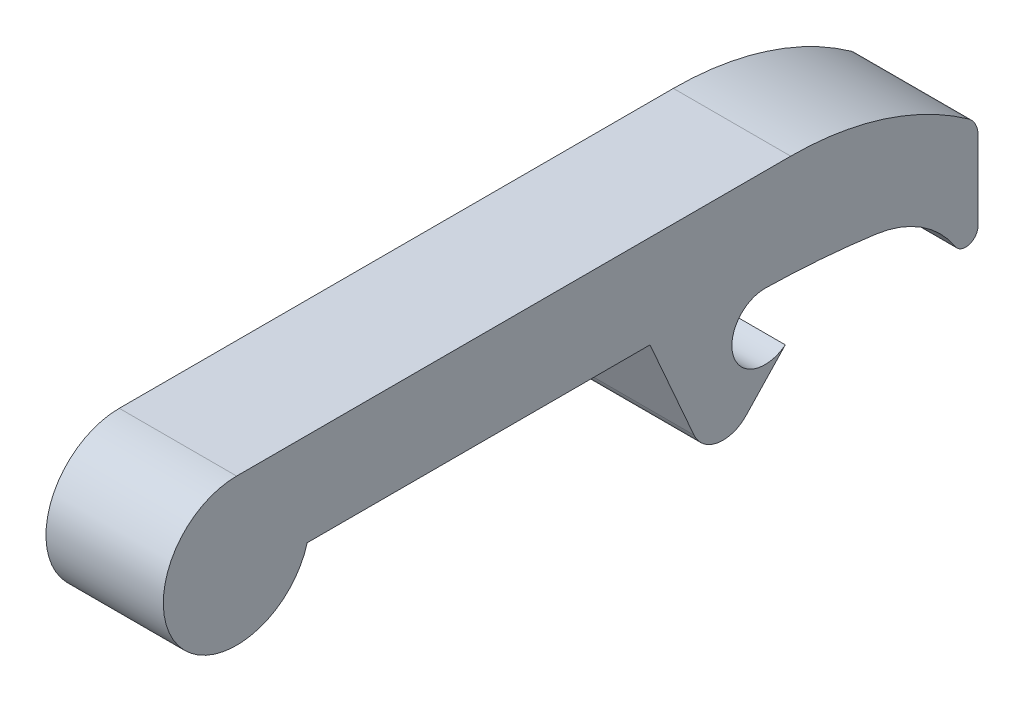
from build123d import *

# Parameters (mm, degrees)
EXTRUDE1_DEPTH = 31.75


with BuildPart() as part:
    # Sketch1 → Extrude1 (new, symmetric)
    with BuildSketch(Plane(origin=(0, 0, 0), x_dir=(0, 0, -1), z_dir=(1, 0, 0))):
        with BuildLine():
            Line((-286.195239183, 21.378739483), (13.620067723, 21.378739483))
            ThreePointArc((13.620067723, 21.378739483), (64.094534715, 13.52893685), (109.801107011, -9.27896679))
            ThreePointArc((109.801107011, -9.27896679), (113.591220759, -13.641995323), (114.956088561, -19.257876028))
            Line((114.956088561, -19.257876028), (114.956088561, -61.971704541))
            ThreePointArc((114.956088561, -61.971704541), (110.187080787, -68.350189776), (102.720112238, -65.580191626))
            ThreePointArc((102.720112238, -65.580191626), (84.244901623, -47.228515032), (59.797785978, -38.258789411))
            ThreePointArc((59.797785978, -38.258789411), (29.967376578, -35.056370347), (0, -33.619306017))
            ThreePointArc((0, -33.619306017), (-17.28683713, -57.168897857), (10.689369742, -65.580191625))
            Line((10.689369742, -65.580191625), (-10.522323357, -88.078959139))
            ThreePointArc((-10.522323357, -88.078959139), (-25.908780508, -93.211279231), (-38.684417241, -83.217937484))
            Line((-38.684417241, -83.217937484), (-62.523647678, -28.979822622))
            Line((-62.523647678, -28.979822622), (-247.993378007, -28.979822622))
            ThreePointArc((-247.993378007, -28.979822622), (-317.799696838, -42.265504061), (-286.195239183, 21.378739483))
        make_face()
    extrude(amount=EXTRUDE1_DEPTH, both=True)


solid = part.part
